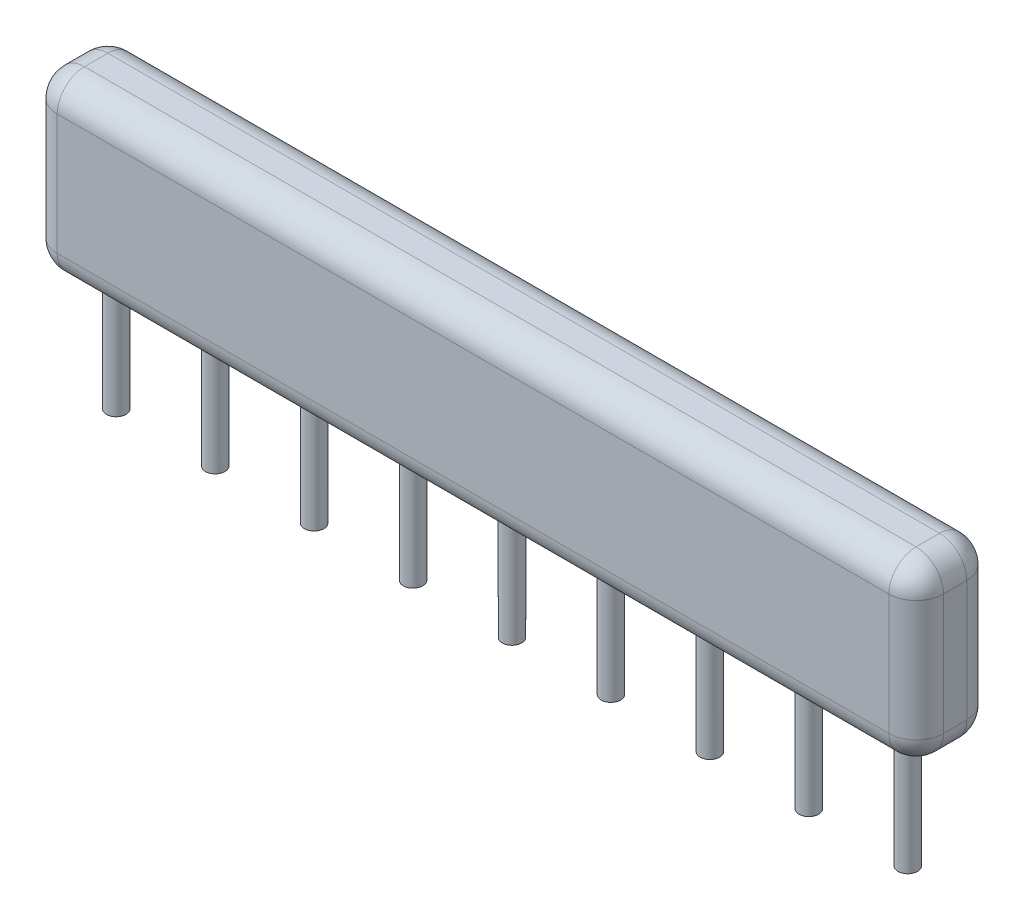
from build123d import *

# Parameters (mm, degrees)
ESQUISSE1_W      = 22.75
ESQUISSE1_H      = 4.5
EXTRUSION1_DEPTH = 2
ESQUISSE2_R      = 0.25
EXTRUSION2_DEPTH = 3
CONG_1_R         = 0.7


with BuildPart() as part:
    # Esquisse1 → Extrusion1 (new body)
    with BuildSketch(Plane.XY):
        with Locations((11.375, 2.25)):
            Rectangle(ESQUISSE1_W, ESQUISSE1_H)
    extrude(amount=EXTRUSION1_DEPTH)

    # Esquisse2 → Extrusion2 (add)
    with BuildSketch(Plane.XZ):
        with Locations(Location((1.215, 1, 0), (0, 0, 90))):
            Circle(ESQUISSE2_R)
        with Locations(Location((3.755, 1, 0), (0, 0, 90))):
            Circle(ESQUISSE2_R)
        with Locations(Location((6.295, 1, 0), (0, 0, 90))):
            Circle(ESQUISSE2_R)
        with Locations(Location((8.835, 1, 0), (0, 0, 90))):
            Circle(ESQUISSE2_R)
        with Locations(Location((11.375, 1, 0), (0, 0, 90))):
            Circle(ESQUISSE2_R)
        with Locations(Location((13.915, 1, 0), (0, 0, 90))):
            Circle(ESQUISSE2_R)
        with Locations(Location((16.455, 1, 0), (0, 0, 90))):
            Circle(ESQUISSE2_R)
        with Locations(Location((18.995, 1, 0), (0, 0, 90))):
            Circle(ESQUISSE2_R)
        with Locations(Location((21.535, 1, 0), (0, 0, 90))):
            Circle(ESQUISSE2_R)
    extrude(amount=EXTRUSION2_DEPTH)

    # Cong_1
    cong_1_edges = [part.edges().sort_by_distance(p)[0] for p in [
        (22.75, 2.25, 2),
        (11.375, 4.5, 2),
        (0, 2.25, 2),
        (11.375, 4.5, 0),
        (22.75, 2.25, 0),
        (11.375, 0, 0),
        (0, 2.25, 0),
        (11.375, 0, 2),
        (0, 4.5, 1),
        (22.75, 4.5, 1),
        (22.75, 0, 1),
        (0, 0, 1),
    ]]
    fillet(cong_1_edges, radius=CONG_1_R)


solid = part.part
